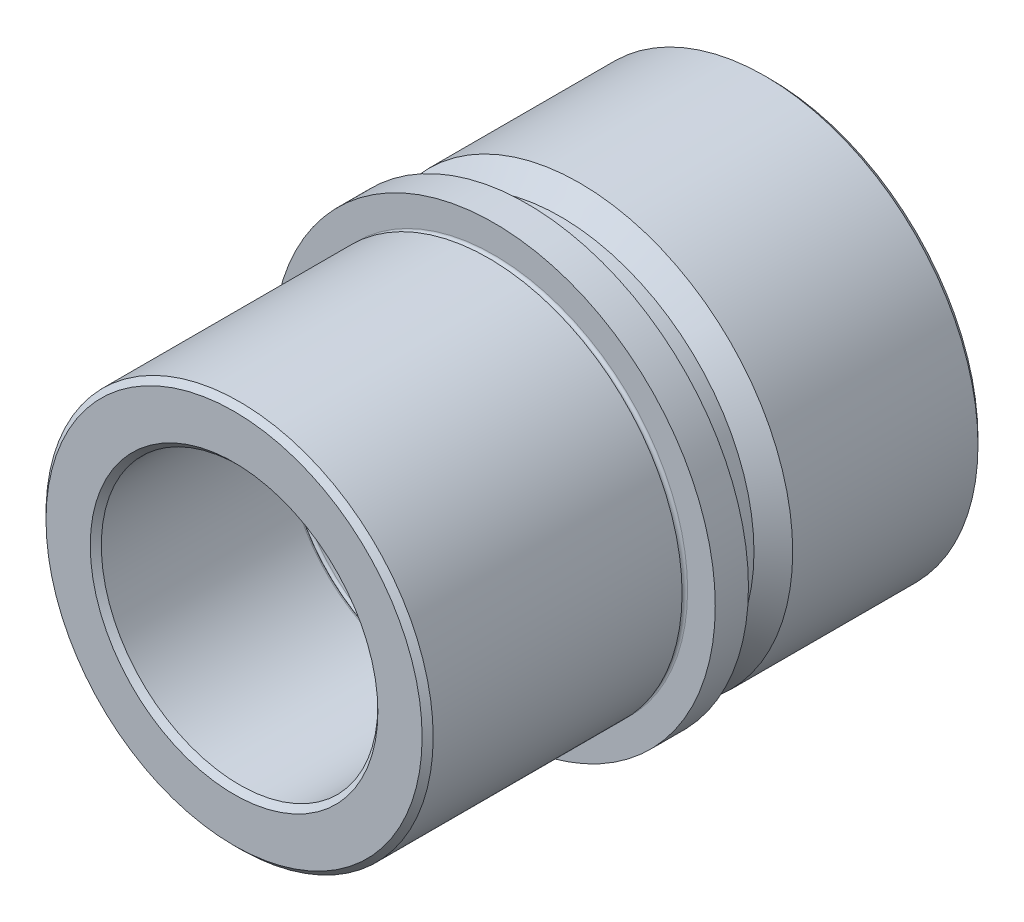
ISO-10303-21;
HEADER;
FILE_DESCRIPTION(('STEP AP214'),'2;1');
FILE_NAME('part.step','',(''),(''),'','','');
FILE_SCHEMA(('AUTOMOTIVE_DESIGN { 1 0 10303 214 1 1 1 1 }'));
ENDSEC;
DATA;
#1=APPLICATION_CONTEXT('core data for automotive mechanical design processes');
#2=APPLICATION_PROTOCOL_DEFINITION('international standard','automotive_design',2000,#1);
#3=PRODUCT_CONTEXT('',#1,'mechanical');
#4=PRODUCT('Part','Part','',(#3));
#5=PRODUCT_RELATED_PRODUCT_CATEGORY('part','',(#4));
#6=PRODUCT_DEFINITION_FORMATION('','',#4);
#7=PRODUCT_DEFINITION_CONTEXT('part definition',#1,'design');
#8=PRODUCT_DEFINITION('design','',#6,#7);
#9=PRODUCT_DEFINITION_SHAPE('','',#8);
#10=(LENGTH_UNIT() NAMED_UNIT(*) SI_UNIT(.MILLI.,.METRE.));
#11=(NAMED_UNIT(*) PLANE_ANGLE_UNIT() SI_UNIT($,.RADIAN.));
#12=(NAMED_UNIT(*) SI_UNIT($,.STERADIAN.) SOLID_ANGLE_UNIT());
#13=UNCERTAINTY_MEASURE_WITH_UNIT(LENGTH_MEASURE(1.E-05),#10,'distance_accuracy_value','');
#14=(GEOMETRIC_REPRESENTATION_CONTEXT(3) GLOBAL_UNCERTAINTY_ASSIGNED_CONTEXT((#13)) GLOBAL_UNIT_ASSIGNED_CONTEXT((#10,
#11,#12)) REPRESENTATION_CONTEXT('',''));
#15=CARTESIAN_POINT('',(0.,0.,0.));
#16=DIRECTION('',(0.,0.,1.));
#17=DIRECTION('',(1.,0.,0.));
#18=AXIS2_PLACEMENT_3D('',#15,#16,#17);
#19=CARTESIAN_POINT('',(0.,0.,-67.5));
#20=DIRECTION('',(0.,0.,1.));
#21=DIRECTION('',(1.,0.,0.));
#22=AXIS2_PLACEMENT_3D('',#19,#20,#21);
#23=TOROIDAL_SURFACE('',#22,25.5,0.5);
#24=CARTESIAN_POINT('',(0.,0.,-67.5));
#25=DIRECTION('',(0.,0.,1.));
#26=DIRECTION('',(1.,0.,0.));
#27=AXIS2_PLACEMENT_3D('',#24,#25,#26);
#28=CIRCLE('',#27,25.);
#29=CARTESIAN_POINT('',(25.,0.,-67.5));
#30=VERTEX_POINT('',#29);
#31=EDGE_CURVE('E81',#30,#30,#28,.T.);
#32=ORIENTED_EDGE('',*,*,#31,.T.);
#33=EDGE_LOOP('',(#32));
#34=FACE_BOUND('',#33,.T.);
#35=CARTESIAN_POINT('',(0.,0.,-68.));
#36=DIRECTION('',(0.,0.,1.));
#37=DIRECTION('',(1.,0.,0.));
#38=AXIS2_PLACEMENT_3D('',#35,#36,#37);
#39=CIRCLE('',#38,25.5);
#40=CARTESIAN_POINT('',(25.5,0.,-68.));
#41=VERTEX_POINT('',#40);
#42=EDGE_CURVE('E45',#41,#41,#39,.T.);
#43=ORIENTED_EDGE('',*,*,#42,.F.);
#44=EDGE_LOOP('',(#43));
#45=FACE_BOUND('',#44,.T.);
#46=ADVANCED_FACE('F13',(#34,#45),#23,.T.);
#47=CARTESIAN_POINT('',(0.,0.,-68.5));
#48=DIRECTION('',(0.,0.,1.));
#49=DIRECTION('',(1.,0.,0.));
#50=AXIS2_PLACEMENT_3D('',#47,#48,#49);
#51=TOROIDAL_SURFACE('',#50,25.5,0.5);
#52=CARTESIAN_POINT('',(0.,0.,-68.5));
#53=DIRECTION('',(0.,0.,1.));
#54=DIRECTION('',(1.,0.,0.));
#55=AXIS2_PLACEMENT_3D('',#52,#53,#54);
#56=CIRCLE('',#55,25.);
#57=CARTESIAN_POINT('',(25.,0.,-68.5));
#58=VERTEX_POINT('',#57);
#59=EDGE_CURVE('E48',#58,#58,#56,.T.);
#60=ORIENTED_EDGE('',*,*,#59,.F.);
#61=EDGE_LOOP('',(#60));
#62=FACE_BOUND('',#61,.T.);
#63=ORIENTED_EDGE('',*,*,#42,.T.);
#64=EDGE_LOOP('',(#63));
#65=FACE_BOUND('',#64,.T.);
#66=ADVANCED_FACE('F114',(#62,#65),#51,.T.);
#67=CARTESIAN_POINT('',(0.,0.,0.));
#68=DIRECTION('',(0.,0.,1.));
#69=DIRECTION('',(1.,0.,0.));
#70=AXIS2_PLACEMENT_3D('',#67,#68,#69);
#71=CYLINDRICAL_SURFACE('',#70,25.);
#72=CARTESIAN_POINT('',(0.,0.,-96.));
#73=DIRECTION('',(0.,0.,1.));
#74=DIRECTION('',(1.,0.,0.));
#75=AXIS2_PLACEMENT_3D('',#72,#73,#74);
#76=CIRCLE('',#75,25.);
#77=CARTESIAN_POINT('',(25.,0.,-96.));
#78=VERTEX_POINT('',#77);
#79=EDGE_CURVE('E36',#78,#78,#76,.F.);
#80=ORIENTED_EDGE('',*,*,#79,.T.);
#81=EDGE_LOOP('',(#80));
#82=FACE_BOUND('',#81,.T.);
#83=ORIENTED_EDGE('',*,*,#59,.T.);
#84=EDGE_LOOP('',(#83));
#85=FACE_BOUND('',#84,.T.);
#86=ADVANCED_FACE('F120',(#82,#85),#71,.F.);
#87=CARTESIAN_POINT('',(0.,0.,-97.));
#88=DIRECTION('',(0.,0.,1.));
#89=DIRECTION('',(1.,0.,0.));
#90=AXIS2_PLACEMENT_3D('',#87,#88,#89);
#91=PLANE('',#90);
#92=CARTESIAN_POINT('',(0.,0.,-97.));
#93=DIRECTION('',(0.,0.,1.));
#94=DIRECTION('',(1.,0.,0.));
#95=AXIS2_PLACEMENT_3D('',#92,#93,#94);
#96=CIRCLE('',#95,26.);
#97=CARTESIAN_POINT('',(26.,0.,-97.));
#98=VERTEX_POINT('',#97);
#99=EDGE_CURVE('E39',#98,#98,#96,.T.);
#100=ORIENTED_EDGE('',*,*,#99,.T.);
#101=EDGE_LOOP('',(#100));
#102=FACE_BOUND('',#101,.T.);
#103=CARTESIAN_POINT('',(0.,0.,-97.));
#104=DIRECTION('',(0.,0.,1.));
#105=DIRECTION('',(1.,0.,0.));
#106=AXIS2_PLACEMENT_3D('',#103,#104,#105);
#107=CIRCLE('',#106,37.5);
#108=CARTESIAN_POINT('',(37.5,0.,-97.));
#109=VERTEX_POINT('',#108);
#110=EDGE_CURVE('E42',#109,#109,#107,.F.);
#111=ORIENTED_EDGE('',*,*,#110,.T.);
#112=EDGE_LOOP('',(#111));
#113=FACE_BOUND('',#112,.T.);
#114=ADVANCED_FACE('F185',(#102,#113),#91,.F.);
#115=CARTESIAN_POINT('',(0.,0.,0.));
#116=DIRECTION('',(0.,0.,1.));
#117=DIRECTION('',(1.,0.,0.));
#118=AXIS2_PLACEMENT_3D('',#115,#116,#117);
#119=CYLINDRICAL_SURFACE('',#118,38.5);
#120=CARTESIAN_POINT('',(0.,0.,-96.));
#121=DIRECTION('',(0.,0.,1.));
#122=DIRECTION('',(1.,0.,0.));
#123=AXIS2_PLACEMENT_3D('',#120,#121,#122);
#124=CIRCLE('',#123,38.5);
#125=CARTESIAN_POINT('',(38.5,0.,-96.));
#126=VERTEX_POINT('',#125);
#127=EDGE_CURVE('E33',#126,#126,#124,.T.);
#128=ORIENTED_EDGE('',*,*,#127,.T.);
#129=EDGE_LOOP('',(#128));
#130=FACE_BOUND('',#129,.T.);
#131=CARTESIAN_POINT('',(0.,0.,-62.5));
#132=DIRECTION('',(0.,0.,1.));
#133=DIRECTION('',(1.,0.,0.));
#134=AXIS2_PLACEMENT_3D('',#131,#132,#133);
#135=CIRCLE('',#134,38.5);
#136=CARTESIAN_POINT('',(38.5,0.,-62.5));
#137=VERTEX_POINT('',#136);
#138=EDGE_CURVE('E51',#137,#137,#135,.T.);
#139=ORIENTED_EDGE('',*,*,#138,.F.);
#140=EDGE_LOOP('',(#139));
#141=FACE_BOUND('',#140,.T.);
#142=ADVANCED_FACE('F181',(#130,#141),#119,.T.);
#143=CARTESIAN_POINT('',(0.,0.,-59.));
#144=DIRECTION('',(0.,0.,-1.));
#145=DIRECTION('',(-1.,0.,0.));
#146=AXIS2_PLACEMENT_3D('',#143,#144,#145);
#147=CONICAL_SURFACE('',#146,35.,0.785398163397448);
#148=ORIENTED_EDGE('',*,*,#138,.T.);
#149=EDGE_LOOP('',(#148));
#150=FACE_BOUND('',#149,.T.);
#151=CARTESIAN_POINT('',(0.,0.,-59.));
#152=DIRECTION('',(0.,0.,1.));
#153=DIRECTION('',(1.,0.,0.));
#154=AXIS2_PLACEMENT_3D('',#151,#152,#153);
#155=CIRCLE('',#154,35.);
#156=CARTESIAN_POINT('',(35.,0.,-59.));
#157=VERTEX_POINT('',#156);
#158=EDGE_CURVE('E54',#157,#157,#155,.T.);
#159=ORIENTED_EDGE('',*,*,#158,.F.);
#160=EDGE_LOOP('',(#159));
#161=FACE_BOUND('',#160,.T.);
#162=ADVANCED_FACE('F177',(#150,#161),#147,.T.);
#163=CARTESIAN_POINT('',(0.,0.,0.));
#164=DIRECTION('',(0.,0.,1.));
#165=DIRECTION('',(1.,0.,0.));
#166=AXIS2_PLACEMENT_3D('',#163,#164,#165);
#167=CYLINDRICAL_SURFACE('',#166,35.);
#168=ORIENTED_EDGE('',*,*,#158,.T.);
#169=EDGE_LOOP('',(#168));
#170=FACE_BOUND('',#169,.T.);
#171=CARTESIAN_POINT('',(0.,0.,-53.));
#172=DIRECTION('',(0.,0.,1.));
#173=DIRECTION('',(1.,0.,0.));
#174=AXIS2_PLACEMENT_3D('',#171,#172,#173);
#175=CIRCLE('',#174,35.);
#176=CARTESIAN_POINT('',(35.,0.,-53.));
#177=VERTEX_POINT('',#176);
#178=EDGE_CURVE('E57',#177,#177,#175,.T.);
#179=ORIENTED_EDGE('',*,*,#178,.F.);
#180=EDGE_LOOP('',(#179));
#181=FACE_BOUND('',#180,.T.);
#182=ADVANCED_FACE('F173',(#170,#181),#167,.T.);
#183=CARTESIAN_POINT('',(0.,0.,-53.));
#184=DIRECTION('',(0.,0.,-1.));
#185=DIRECTION('',(-1.,0.,0.));
#186=AXIS2_PLACEMENT_3D('',#183,#184,#185);
#187=PLANE('',#186);
#188=ORIENTED_EDGE('',*,*,#178,.T.);
#189=EDGE_LOOP('',(#188));
#190=FACE_BOUND('',#189,.T.);
#191=CARTESIAN_POINT('',(0.,0.,-53.));
#192=DIRECTION('',(0.,0.,1.));
#193=DIRECTION('',(1.,0.,0.));
#194=AXIS2_PLACEMENT_3D('',#191,#192,#193);
#195=CIRCLE('',#194,40.);
#196=CARTESIAN_POINT('',(40.,0.,-53.));
#197=VERTEX_POINT('',#196);
#198=EDGE_CURVE('E60',#197,#197,#195,.T.);
#199=ORIENTED_EDGE('',*,*,#198,.F.);
#200=EDGE_LOOP('',(#199));
#201=FACE_BOUND('',#200,.T.);
#202=ADVANCED_FACE('F169',(#190,#201),#187,.T.);
#203=CARTESIAN_POINT('',(0.,0.,0.));
#204=DIRECTION('',(0.,0.,1.));
#205=DIRECTION('',(1.,0.,0.));
#206=AXIS2_PLACEMENT_3D('',#203,#204,#205);
#207=CYLINDRICAL_SURFACE('',#206,40.);
#208=ORIENTED_EDGE('',*,*,#198,.T.);
#209=EDGE_LOOP('',(#208));
#210=FACE_BOUND('',#209,.T.);
#211=CARTESIAN_POINT('',(0.,0.,-47.));
#212=DIRECTION('',(0.,0.,1.));
#213=DIRECTION('',(1.,0.,0.));
#214=AXIS2_PLACEMENT_3D('',#211,#212,#213);
#215=CIRCLE('',#214,40.);
#216=CARTESIAN_POINT('',(40.,0.,-47.));
#217=VERTEX_POINT('',#216);
#218=EDGE_CURVE('E63',#217,#217,#215,.T.);
#219=ORIENTED_EDGE('',*,*,#218,.F.);
#220=EDGE_LOOP('',(#219));
#221=FACE_BOUND('',#220,.T.);
#222=ADVANCED_FACE('F165',(#210,#221),#207,.T.);
#223=CARTESIAN_POINT('',(0.,0.,-47.));
#224=DIRECTION('',(0.,0.,1.));
#225=DIRECTION('',(1.,0.,0.));
#226=AXIS2_PLACEMENT_3D('',#223,#224,#225);
#227=PLANE('',#226);
#228=ORIENTED_EDGE('',*,*,#218,.T.);
#229=EDGE_LOOP('',(#228));
#230=FACE_BOUND('',#229,.T.);
#231=CARTESIAN_POINT('',(0.,0.,-47.));
#232=DIRECTION('',(0.,0.,1.));
#233=DIRECTION('',(1.,0.,0.));
#234=AXIS2_PLACEMENT_3D('',#231,#232,#233);
#235=CIRCLE('',#234,35.);
#236=CARTESIAN_POINT('',(35.,0.,-47.));
#237=VERTEX_POINT('',#236);
#238=EDGE_CURVE('E66',#237,#237,#235,.T.);
#239=ORIENTED_EDGE('',*,*,#238,.F.);
#240=EDGE_LOOP('',(#239));
#241=FACE_BOUND('',#240,.T.);
#242=ADVANCED_FACE('F161',(#230,#241),#227,.T.);
#243=CARTESIAN_POINT('',(0.,0.,-46.5));
#244=DIRECTION('',(0.,0.,1.));
#245=DIRECTION('',(1.,0.,0.));
#246=AXIS2_PLACEMENT_3D('',#243,#244,#245);
#247=TOROIDAL_SURFACE('',#246,35.,0.5);
#248=ORIENTED_EDGE('',*,*,#238,.T.);
#249=EDGE_LOOP('',(#248));
#250=FACE_BOUND('',#249,.T.);
#251=CARTESIAN_POINT('',(0.,0.,-46.));
#252=DIRECTION('',(0.,0.,1.));
#253=DIRECTION('',(1.,0.,0.));
#254=AXIS2_PLACEMENT_3D('',#251,#252,#253);
#255=CIRCLE('',#254,35.);
#256=CARTESIAN_POINT('',(35.,0.,-46.));
#257=VERTEX_POINT('',#256);
#258=EDGE_CURVE('E69',#257,#257,#255,.T.);
#259=ORIENTED_EDGE('',*,*,#258,.F.);
#260=EDGE_LOOP('',(#259));
#261=FACE_BOUND('',#260,.T.);
#262=ADVANCED_FACE('F156',(#250,#261),#247,.F.);
#263=CARTESIAN_POINT('',(0.,0.,0.));
#264=DIRECTION('',(0.,0.,1.));
#265=DIRECTION('',(1.,0.,0.));
#266=AXIS2_PLACEMENT_3D('',#263,#264,#265);
#267=CYLINDRICAL_SURFACE('',#266,35.);
#268=CARTESIAN_POINT('',(0.,0.,-1.00000000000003));
#269=DIRECTION('',(0.,0.,1.));
#270=DIRECTION('',(1.,0.,0.));
#271=AXIS2_PLACEMENT_3D('',#268,#269,#270);
#272=CIRCLE('',#271,35.);
#273=CARTESIAN_POINT('',(35.,0.,-1.00000000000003));
#274=VERTEX_POINT('',#273);
#275=EDGE_CURVE('E8',#274,#274,#272,.F.);
#276=ORIENTED_EDGE('',*,*,#275,.T.);
#277=EDGE_LOOP('',(#276));
#278=FACE_BOUND('',#277,.T.);
#279=ORIENTED_EDGE('',*,*,#258,.T.);
#280=EDGE_LOOP('',(#279));
#281=FACE_BOUND('',#280,.T.);
#282=ADVANCED_FACE('F150',(#278,#281),#267,.T.);
#283=CARTESIAN_POINT('',(0.,0.,0.));
#284=DIRECTION('',(0.,0.,1.));
#285=DIRECTION('',(1.,0.,0.));
#286=AXIS2_PLACEMENT_3D('',#283,#284,#285);
#287=PLANE('',#286);
#288=CARTESIAN_POINT('',(0.,0.,0.));
#289=DIRECTION('',(0.,0.,1.));
#290=DIRECTION('',(1.,0.,0.));
#291=AXIS2_PLACEMENT_3D('',#288,#289,#290);
#292=CIRCLE('',#291,26.);
#293=CARTESIAN_POINT('',(26.,0.,0.));
#294=VERTEX_POINT('',#293);
#295=EDGE_CURVE('E20',#294,#294,#292,.F.);
#296=ORIENTED_EDGE('',*,*,#295,.T.);
#297=EDGE_LOOP('',(#296));
#298=FACE_BOUND('',#297,.T.);
#299=CARTESIAN_POINT('',(0.,0.,0.));
#300=DIRECTION('',(0.,0.,1.));
#301=DIRECTION('',(1.,0.,0.));
#302=AXIS2_PLACEMENT_3D('',#299,#300,#301);
#303=CIRCLE('',#302,34.);
#304=CARTESIAN_POINT('',(34.,0.,0.));
#305=VERTEX_POINT('',#304);
#306=EDGE_CURVE('E24',#305,#305,#303,.T.);
#307=ORIENTED_EDGE('',*,*,#306,.T.);
#308=EDGE_LOOP('',(#307));
#309=FACE_BOUND('',#308,.T.);
#310=ADVANCED_FACE('F110',(#298,#309),#287,.T.);
#311=CARTESIAN_POINT('',(0.,0.,0.));
#312=DIRECTION('',(0.,0.,1.));
#313=DIRECTION('',(1.,0.,0.));
#314=AXIS2_PLACEMENT_3D('',#311,#312,#313);
#315=CYLINDRICAL_SURFACE('',#314,25.);
#316=CARTESIAN_POINT('',(0.,0.,-1.00000000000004));
#317=DIRECTION('',(0.,0.,1.));
#318=DIRECTION('',(1.,0.,0.));
#319=AXIS2_PLACEMENT_3D('',#316,#317,#318);
#320=CIRCLE('',#319,25.);
#321=CARTESIAN_POINT('',(25.,0.,-1.00000000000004));
#322=VERTEX_POINT('',#321);
#323=EDGE_CURVE('E28',#322,#322,#320,.T.);
#324=ORIENTED_EDGE('',*,*,#323,.T.);
#325=EDGE_LOOP('',(#324));
#326=FACE_BOUND('',#325,.T.);
#327=CARTESIAN_POINT('',(0.,0.,-34.5));
#328=DIRECTION('',(0.,0.,1.));
#329=DIRECTION('',(1.,0.,0.));
#330=AXIS2_PLACEMENT_3D('',#327,#328,#329);
#331=CIRCLE('',#330,25.);
#332=CARTESIAN_POINT('',(25.,0.,-34.5));
#333=VERTEX_POINT('',#332);
#334=EDGE_CURVE('E72',#333,#333,#331,.T.);
#335=ORIENTED_EDGE('',*,*,#334,.F.);
#336=EDGE_LOOP('',(#335));
#337=FACE_BOUND('',#336,.T.);
#338=ADVANCED_FACE('F102',(#326,#337),#315,.F.);
#339=CARTESIAN_POINT('',(0.,0.,-34.5));
#340=DIRECTION('',(0.,0.,1.));
#341=DIRECTION('',(1.,0.,0.));
#342=AXIS2_PLACEMENT_3D('',#339,#340,#341);
#343=TOROIDAL_SURFACE('',#342,25.5,0.5);
#344=ORIENTED_EDGE('',*,*,#334,.T.);
#345=EDGE_LOOP('',(#344));
#346=FACE_BOUND('',#345,.T.);
#347=CARTESIAN_POINT('',(0.,0.,-35.));
#348=DIRECTION('',(0.,0.,1.));
#349=DIRECTION('',(1.,0.,0.));
#350=AXIS2_PLACEMENT_3D('',#347,#348,#349);
#351=CIRCLE('',#350,25.5);
#352=CARTESIAN_POINT('',(25.5,0.,-35.));
#353=VERTEX_POINT('',#352);
#354=EDGE_CURVE('E75',#353,#353,#351,.T.);
#355=ORIENTED_EDGE('',*,*,#354,.F.);
#356=EDGE_LOOP('',(#355));
#357=FACE_BOUND('',#356,.T.);
#358=ADVANCED_FACE('F97',(#346,#357),#343,.T.);
#359=CARTESIAN_POINT('',(0.,0.,-35.5));
#360=DIRECTION('',(0.,0.,1.));
#361=DIRECTION('',(1.,0.,0.));
#362=AXIS2_PLACEMENT_3D('',#359,#360,#361);
#363=TOROIDAL_SURFACE('',#362,25.5,0.5);
#364=CARTESIAN_POINT('',(0.,0.,-35.5));
#365=DIRECTION('',(0.,0.,1.));
#366=DIRECTION('',(1.,0.,0.));
#367=AXIS2_PLACEMENT_3D('',#364,#365,#366);
#368=CIRCLE('',#367,25.);
#369=CARTESIAN_POINT('',(25.,0.,-35.5));
#370=VERTEX_POINT('',#369);
#371=EDGE_CURVE('E78',#370,#370,#368,.T.);
#372=ORIENTED_EDGE('',*,*,#371,.F.);
#373=EDGE_LOOP('',(#372));
#374=FACE_BOUND('',#373,.T.);
#375=ORIENTED_EDGE('',*,*,#354,.T.);
#376=EDGE_LOOP('',(#375));
#377=FACE_BOUND('',#376,.T.);
#378=ADVANCED_FACE('F91',(#374,#377),#363,.T.);
#379=CARTESIAN_POINT('',(0.,0.,0.));
#380=DIRECTION('',(0.,0.,1.));
#381=DIRECTION('',(1.,0.,0.));
#382=AXIS2_PLACEMENT_3D('',#379,#380,#381);
#383=CYLINDRICAL_SURFACE('',#382,25.);
#384=ORIENTED_EDGE('',*,*,#31,.F.);
#385=EDGE_LOOP('',(#384));
#386=FACE_BOUND('',#385,.T.);
#387=ORIENTED_EDGE('',*,*,#371,.T.);
#388=EDGE_LOOP('',(#387));
#389=FACE_BOUND('',#388,.T.);
#390=ADVANCED_FACE('F87',(#386,#389),#383,.F.);
#391=CARTESIAN_POINT('',(0.,0.,-97.));
#392=DIRECTION('',(0.,0.,-1.));
#393=DIRECTION('',(-1.,0.,0.));
#394=AXIS2_PLACEMENT_3D('',#391,#392,#393);
#395=CONICAL_SURFACE('',#394,26.,0.785398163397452);
#396=ORIENTED_EDGE('',*,*,#79,.F.);
#397=EDGE_LOOP('',(#396));
#398=FACE_BOUND('',#397,.T.);
#399=ORIENTED_EDGE('',*,*,#99,.F.);
#400=EDGE_LOOP('',(#399));
#401=FACE_BOUND('',#400,.T.);
#402=ADVANCED_FACE('F90',(#398,#401),#395,.F.);
#403=CARTESIAN_POINT('',(0.,0.,-96.));
#404=DIRECTION('',(0.,0.,1.));
#405=DIRECTION('',(1.,0.,0.));
#406=AXIS2_PLACEMENT_3D('',#403,#404,#405);
#407=CONICAL_SURFACE('',#406,38.5,0.785398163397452);
#408=ORIENTED_EDGE('',*,*,#110,.F.);
#409=EDGE_LOOP('',(#408));
#410=FACE_BOUND('',#409,.T.);
#411=ORIENTED_EDGE('',*,*,#127,.F.);
#412=EDGE_LOOP('',(#411));
#413=FACE_BOUND('',#412,.T.);
#414=ADVANCED_FACE('F127',(#410,#413),#407,.T.);
#415=CARTESIAN_POINT('',(0.,0.,-1.00000000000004));
#416=DIRECTION('',(0.,0.,1.));
#417=DIRECTION('',(1.,0.,0.));
#418=AXIS2_PLACEMENT_3D('',#415,#416,#417);
#419=CONICAL_SURFACE('',#418,25.,0.785398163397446);
#420=ORIENTED_EDGE('',*,*,#295,.F.);
#421=EDGE_LOOP('',(#420));
#422=FACE_BOUND('',#421,.T.);
#423=ORIENTED_EDGE('',*,*,#323,.F.);
#424=EDGE_LOOP('',(#423));
#425=FACE_BOUND('',#424,.T.);
#426=ADVANCED_FACE('F130',(#422,#425),#419,.F.);
#427=CARTESIAN_POINT('',(0.,0.,0.));
#428=DIRECTION('',(0.,0.,-1.));
#429=DIRECTION('',(-1.,0.,0.));
#430=AXIS2_PLACEMENT_3D('',#427,#428,#429);
#431=CONICAL_SURFACE('',#430,34.,0.785398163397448);
#432=ORIENTED_EDGE('',*,*,#275,.F.);
#433=EDGE_LOOP('',(#432));
#434=FACE_BOUND('',#433,.T.);
#435=ORIENTED_EDGE('',*,*,#306,.F.);
#436=EDGE_LOOP('',(#435));
#437=FACE_BOUND('',#436,.T.);
#438=ADVANCED_FACE('F15',(#434,#437),#431,.T.);
#439=CLOSED_SHELL('',(#46,#66,#86,#114,#142,#162,#182,#202,#222,#242,#262,#282,#310,#338,#358,
#378,#390,#402,#414,#426,#438));
#440=MANIFOLD_SOLID_BREP('B1',#439);
#441=ADVANCED_BREP_SHAPE_REPRESENTATION('',(#18,#440),#14);
#442=SHAPE_DEFINITION_REPRESENTATION(#9,#441);
ENDSEC;
END-ISO-10303-21;
